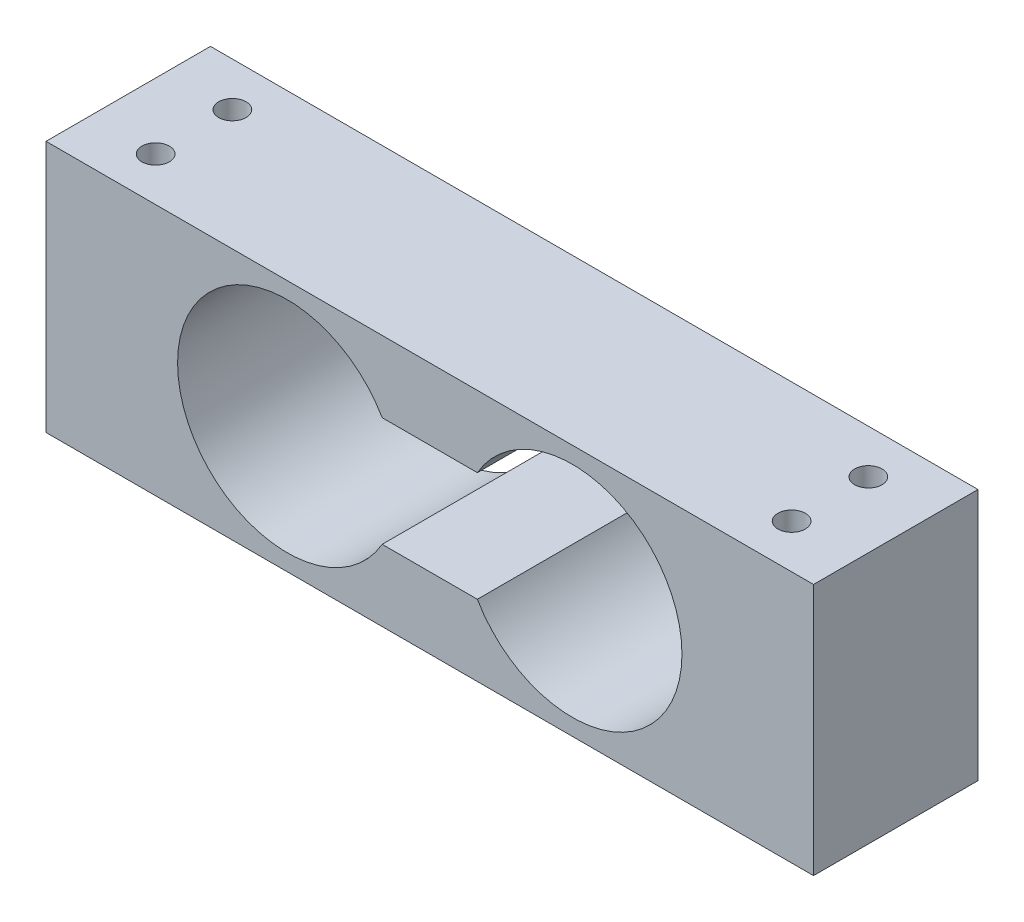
from build123d import *

# Parameters (mm, degrees)
ESQUISSE1_W           = 70
ESQUISSE1_H           = 23
EXTRUSION1_DEPTH      = 7.5
TROU_TARAUD_M3X0_51_D = 2.5


with BuildPart() as part:
    # Esquisse1 → Extrusion1 (new, symmetric)
    with BuildSketch(Plane.XY):
        with Locations((-35, 11.5)):
            Rectangle(ESQUISSE1_W, ESQUISSE1_H)
        with BuildLine():
            Line((-39.339745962, 16.5), (-30.660254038, 16.5))
            ThreePointArc((-30.660254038, 16.5), (-12, 11.5), (-30.660254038, 6.5))
            Line((-30.660254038, 6.5), (-39.339745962, 6.5))
            ThreePointArc((-39.339745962, 6.5), (-58, 11.5), (-39.339745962, 16.5))
        make_face(mode=Mode.SUBTRACT)
    extrude(amount=EXTRUSION1_DEPTH, both=True)

    # Trou taraud_ M3x0.51 (through all)
    with Locations(Plane(origin=(-64, 23, -3.5), x_dir=(1, 0, 0), z_dir=(0, 1, 0))):
        with Locations((0, 0), (0, -7), (58, 0), (58, -7)):
            Hole(TROU_TARAUD_M3X0_51_D / 2)


solid = part.part
